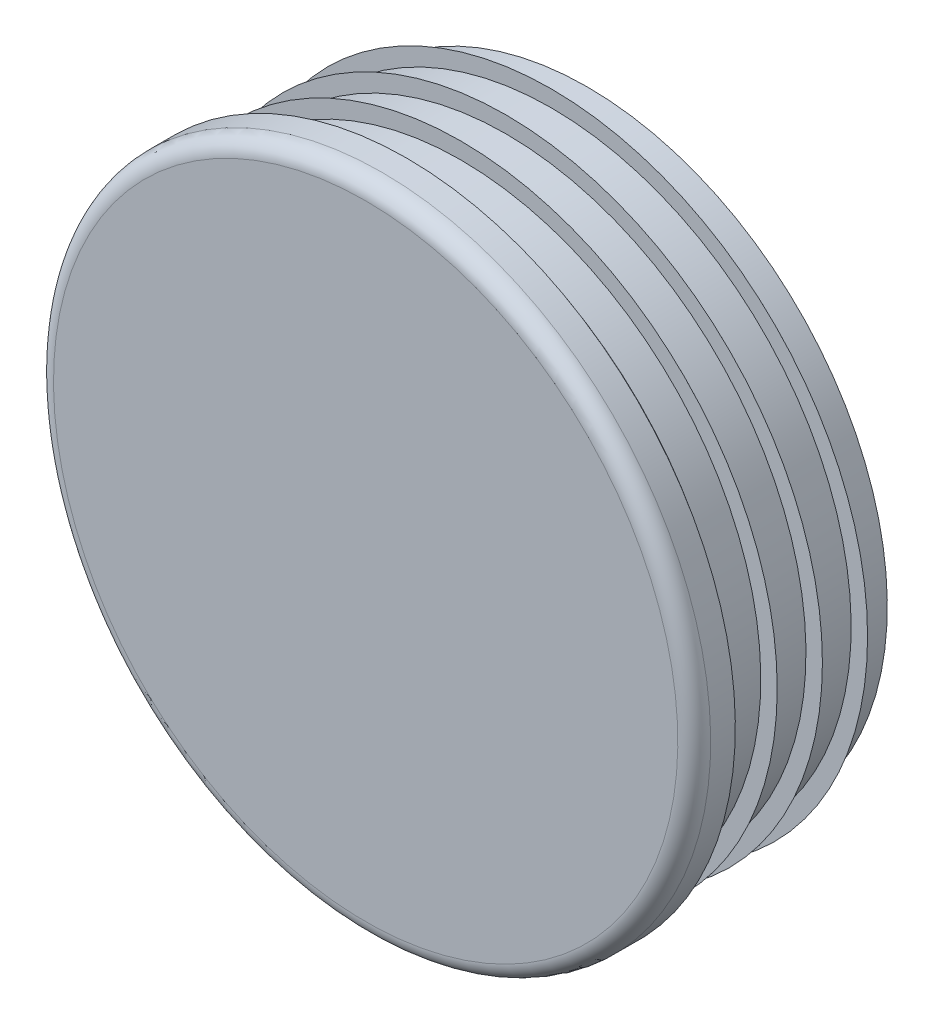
ISO-10303-21;
HEADER;
FILE_DESCRIPTION(('STEP AP214'),'2;1');
FILE_NAME('part.step','',(''),(''),'','','');
FILE_SCHEMA(('AUTOMOTIVE_DESIGN { 1 0 10303 214 1 1 1 1 }'));
ENDSEC;
DATA;
#1=APPLICATION_CONTEXT('core data for automotive mechanical design processes');
#2=APPLICATION_PROTOCOL_DEFINITION('international standard','automotive_design',2000,#1);
#3=PRODUCT_CONTEXT('',#1,'mechanical');
#4=PRODUCT('Part','Part','',(#3));
#5=PRODUCT_RELATED_PRODUCT_CATEGORY('part','',(#4));
#6=PRODUCT_DEFINITION_FORMATION('','',#4);
#7=PRODUCT_DEFINITION_CONTEXT('part definition',#1,'design');
#8=PRODUCT_DEFINITION('design','',#6,#7);
#9=PRODUCT_DEFINITION_SHAPE('','',#8);
#10=(LENGTH_UNIT() NAMED_UNIT(*) SI_UNIT(.MILLI.,.METRE.));
#11=(NAMED_UNIT(*) PLANE_ANGLE_UNIT() SI_UNIT($,.RADIAN.));
#12=(NAMED_UNIT(*) SI_UNIT($,.STERADIAN.) SOLID_ANGLE_UNIT());
#13=UNCERTAINTY_MEASURE_WITH_UNIT(LENGTH_MEASURE(1.E-05),#10,'distance_accuracy_value','');
#14=(GEOMETRIC_REPRESENTATION_CONTEXT(3) GLOBAL_UNCERTAINTY_ASSIGNED_CONTEXT((#13)) GLOBAL_UNIT_ASSIGNED_CONTEXT((#10,
#11,#12)) REPRESENTATION_CONTEXT('',''));
#15=CARTESIAN_POINT('',(0.,0.,0.));
#16=DIRECTION('',(0.,0.,1.));
#17=DIRECTION('',(1.,0.,0.));
#18=AXIS2_PLACEMENT_3D('',#15,#16,#17);
#19=CARTESIAN_POINT('',(0.,0.,5.));
#20=DIRECTION('',(0.,0.,-1.));
#21=DIRECTION('',(0.,1.,0.));
#22=AXIS2_PLACEMENT_3D('',#19,#20,#21);
#23=PLANE('',#22);
#24=CARTESIAN_POINT('',(0.,0.,5.));
#25=DIRECTION('',(0.,0.,-1.));
#26=DIRECTION('',(0.,1.,0.));
#27=AXIS2_PLACEMENT_3D('',#24,#25,#26);
#28=CIRCLE('',#27,38.);
#29=CARTESIAN_POINT('',(0.,38.,5.));
#30=VERTEX_POINT('',#29);
#31=EDGE_CURVE('E8',#30,#30,#28,.T.);
#32=ORIENTED_EDGE('',*,*,#31,.F.);
#33=EDGE_LOOP('',(#32));
#34=FACE_BOUND('',#33,.T.);
#35=ADVANCED_FACE('F12',(#34),#23,.F.);
#36=CARTESIAN_POINT('',(0.,0.,3.));
#37=DIRECTION('',(0.,0.,-1.));
#38=DIRECTION('',(0.,1.,0.));
#39=AXIS2_PLACEMENT_3D('',#36,#37,#38);
#40=TOROIDAL_SURFACE('',#39,38.,2.);
#41=ORIENTED_EDGE('',*,*,#31,.T.);
#42=EDGE_LOOP('',(#41));
#43=FACE_BOUND('',#42,.T.);
#44=CARTESIAN_POINT('',(0.,0.,3.));
#45=DIRECTION('',(0.,0.,-1.));
#46=DIRECTION('',(0.,1.,0.));
#47=AXIS2_PLACEMENT_3D('',#44,#45,#46);
#48=CIRCLE('',#47,40.);
#49=CARTESIAN_POINT('',(0.,40.,3.));
#50=VERTEX_POINT('',#49);
#51=EDGE_CURVE('E18',#50,#50,#48,.T.);
#52=ORIENTED_EDGE('',*,*,#51,.F.);
#53=EDGE_LOOP('',(#52));
#54=FACE_BOUND('',#53,.T.);
#55=ADVANCED_FACE('F159',(#43,#54),#40,.T.);
#56=CARTESIAN_POINT('',(0.,0.,-22.));
#57=DIRECTION('',(0.,0.,-1.));
#58=DIRECTION('',(0.,1.,0.));
#59=AXIS2_PLACEMENT_3D('',#56,#57,#58);
#60=CYLINDRICAL_SURFACE('',#59,40.);
#61=CARTESIAN_POINT('',(0.,0.,0.));
#62=DIRECTION('',(0.,0.,-1.));
#63=DIRECTION('',(0.,1.,0.));
#64=AXIS2_PLACEMENT_3D('',#61,#62,#63);
#65=CIRCLE('',#64,40.);
#66=CARTESIAN_POINT('',(0.,40.,0.));
#67=VERTEX_POINT('',#66);
#68=EDGE_CURVE('E22',#67,#67,#65,.T.);
#69=ORIENTED_EDGE('',*,*,#68,.F.);
#70=EDGE_LOOP('',(#69));
#71=FACE_BOUND('',#70,.T.);
#72=ORIENTED_EDGE('',*,*,#51,.T.);
#73=EDGE_LOOP('',(#72));
#74=FACE_BOUND('',#73,.T.);
#75=ADVANCED_FACE('F154',(#71,#74),#60,.T.);
#76=CARTESIAN_POINT('',(40.,0.,0.));
#77=DIRECTION('',(0.,0.,1.));
#78=DIRECTION('',(0.,-1.,0.));
#79=AXIS2_PLACEMENT_3D('',#76,#77,#78);
#80=PLANE('',#79);
#81=CARTESIAN_POINT('',(0.,0.,0.));
#82=DIRECTION('',(0.,0.,-1.));
#83=DIRECTION('',(0.,1.,0.));
#84=AXIS2_PLACEMENT_3D('',#81,#82,#83);
#85=CIRCLE('',#84,36.5);
#86=CARTESIAN_POINT('',(0.,36.5,0.));
#87=VERTEX_POINT('',#86);
#88=EDGE_CURVE('E26',#87,#87,#85,.T.);
#89=ORIENTED_EDGE('',*,*,#88,.F.);
#90=EDGE_LOOP('',(#89));
#91=FACE_BOUND('',#90,.T.);
#92=ORIENTED_EDGE('',*,*,#68,.T.);
#93=EDGE_LOOP('',(#92));
#94=FACE_BOUND('',#93,.T.);
#95=ADVANCED_FACE('F148',(#91,#94),#80,.F.);
#96=CARTESIAN_POINT('',(0.,0.,-22.));
#97=DIRECTION('',(0.,0.,-1.));
#98=DIRECTION('',(0.,1.,0.));
#99=AXIS2_PLACEMENT_3D('',#96,#97,#98);
#100=CYLINDRICAL_SURFACE('',#99,36.5);
#101=CARTESIAN_POINT('',(0.,0.,-1.1));
#102=DIRECTION('',(0.,0.,-1.));
#103=DIRECTION('',(0.,1.,0.));
#104=AXIS2_PLACEMENT_3D('',#101,#102,#103);
#105=CIRCLE('',#104,36.5);
#106=CARTESIAN_POINT('',(0.,36.5,-1.1));
#107=VERTEX_POINT('',#106);
#108=EDGE_CURVE('E31',#107,#107,#105,.T.);
#109=ORIENTED_EDGE('',*,*,#108,.F.);
#110=EDGE_LOOP('',(#109));
#111=FACE_BOUND('',#110,.T.);
#112=ORIENTED_EDGE('',*,*,#88,.T.);
#113=EDGE_LOOP('',(#112));
#114=FACE_BOUND('',#113,.T.);
#115=ADVANCED_FACE('F142',(#111,#114),#100,.T.);
#116=CARTESIAN_POINT('',(36.5,0.,-1.1));
#117=DIRECTION('',(0.,0.,-1.));
#118=DIRECTION('',(0.,1.,0.));
#119=AXIS2_PLACEMENT_3D('',#116,#117,#118);
#120=PLANE('',#119);
#121=CARTESIAN_POINT('',(0.,0.,-1.1));
#122=DIRECTION('',(0.,0.,-1.));
#123=DIRECTION('',(0.,1.,0.));
#124=AXIS2_PLACEMENT_3D('',#121,#122,#123);
#125=CIRCLE('',#124,38.5);
#126=CARTESIAN_POINT('',(0.,38.5,-1.1));
#127=VERTEX_POINT('',#126);
#128=EDGE_CURVE('E34',#127,#127,#125,.T.);
#129=ORIENTED_EDGE('',*,*,#128,.F.);
#130=EDGE_LOOP('',(#129));
#131=FACE_BOUND('',#130,.T.);
#132=ORIENTED_EDGE('',*,*,#108,.T.);
#133=EDGE_LOOP('',(#132));
#134=FACE_BOUND('',#133,.T.);
#135=ADVANCED_FACE('F136',(#131,#134),#120,.F.);
#136=CARTESIAN_POINT('',(0.,0.,-1.1));
#137=DIRECTION('',(0.,0.,1.));
#138=DIRECTION('',(0.,-1.,0.));
#139=AXIS2_PLACEMENT_3D('',#136,#137,#138);
#140=CONICAL_SURFACE('',#139,38.5,0.959931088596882);
#141=CARTESIAN_POINT('',(0.,0.,-2.50041507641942));
#142=DIRECTION('',(0.,0.,-1.));
#143=DIRECTION('',(0.,1.,0.));
#144=AXIS2_PLACEMENT_3D('',#141,#142,#143);
#145=CIRCLE('',#144,36.5);
#146=CARTESIAN_POINT('',(0.,36.5,-2.50041507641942));
#147=VERTEX_POINT('',#146);
#148=EDGE_CURVE('E37',#147,#147,#145,.T.);
#149=ORIENTED_EDGE('',*,*,#148,.F.);
#150=EDGE_LOOP('',(#149));
#151=FACE_BOUND('',#150,.T.);
#152=ORIENTED_EDGE('',*,*,#128,.T.);
#153=EDGE_LOOP('',(#152));
#154=FACE_BOUND('',#153,.T.);
#155=ADVANCED_FACE('F130',(#151,#154),#140,.T.);
#156=CARTESIAN_POINT('',(0.,0.,-22.));
#157=DIRECTION('',(0.,0.,-1.));
#158=DIRECTION('',(0.,1.,0.));
#159=AXIS2_PLACEMENT_3D('',#156,#157,#158);
#160=CYLINDRICAL_SURFACE('',#159,36.5);
#161=CARTESIAN_POINT('',(0.,0.,-6.6));
#162=DIRECTION('',(0.,0.,-1.));
#163=DIRECTION('',(0.,1.,0.));
#164=AXIS2_PLACEMENT_3D('',#161,#162,#163);
#165=CIRCLE('',#164,36.5);
#166=CARTESIAN_POINT('',(0.,36.5,-6.6));
#167=VERTEX_POINT('',#166);
#168=EDGE_CURVE('E40',#167,#167,#165,.T.);
#169=ORIENTED_EDGE('',*,*,#168,.F.);
#170=EDGE_LOOP('',(#169));
#171=FACE_BOUND('',#170,.T.);
#172=ORIENTED_EDGE('',*,*,#148,.T.);
#173=EDGE_LOOP('',(#172));
#174=FACE_BOUND('',#173,.T.);
#175=ADVANCED_FACE('F124',(#171,#174),#160,.T.);
#176=CARTESIAN_POINT('',(36.5,0.,-6.6));
#177=DIRECTION('',(0.,0.,-1.));
#178=DIRECTION('',(0.,1.,0.));
#179=AXIS2_PLACEMENT_3D('',#176,#177,#178);
#180=PLANE('',#179);
#181=CARTESIAN_POINT('',(0.,0.,-6.6));
#182=DIRECTION('',(0.,0.,-1.));
#183=DIRECTION('',(0.,1.,0.));
#184=AXIS2_PLACEMENT_3D('',#181,#182,#183);
#185=CIRCLE('',#184,38.5);
#186=CARTESIAN_POINT('',(0.,38.5,-6.6));
#187=VERTEX_POINT('',#186);
#188=EDGE_CURVE('E43',#187,#187,#185,.T.);
#189=ORIENTED_EDGE('',*,*,#188,.F.);
#190=EDGE_LOOP('',(#189));
#191=FACE_BOUND('',#190,.T.);
#192=ORIENTED_EDGE('',*,*,#168,.T.);
#193=EDGE_LOOP('',(#192));
#194=FACE_BOUND('',#193,.T.);
#195=ADVANCED_FACE('F118',(#191,#194),#180,.F.);
#196=CARTESIAN_POINT('',(0.,0.,-6.6));
#197=DIRECTION('',(0.,0.,1.));
#198=DIRECTION('',(0.,-1.,0.));
#199=AXIS2_PLACEMENT_3D('',#196,#197,#198);
#200=CONICAL_SURFACE('',#199,38.5,0.959931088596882);
#201=CARTESIAN_POINT('',(0.,0.,-8.00041507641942));
#202=DIRECTION('',(0.,0.,-1.));
#203=DIRECTION('',(0.,1.,0.));
#204=AXIS2_PLACEMENT_3D('',#201,#202,#203);
#205=CIRCLE('',#204,36.5);
#206=CARTESIAN_POINT('',(0.,36.5,-8.00041507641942));
#207=VERTEX_POINT('',#206);
#208=EDGE_CURVE('E46',#207,#207,#205,.T.);
#209=ORIENTED_EDGE('',*,*,#208,.F.);
#210=EDGE_LOOP('',(#209));
#211=FACE_BOUND('',#210,.T.);
#212=ORIENTED_EDGE('',*,*,#188,.T.);
#213=EDGE_LOOP('',(#212));
#214=FACE_BOUND('',#213,.T.);
#215=ADVANCED_FACE('F112',(#211,#214),#200,.T.);
#216=CARTESIAN_POINT('',(0.,0.,-22.));
#217=DIRECTION('',(0.,0.,-1.));
#218=DIRECTION('',(0.,1.,0.));
#219=AXIS2_PLACEMENT_3D('',#216,#217,#218);
#220=CYLINDRICAL_SURFACE('',#219,36.5);
#221=CARTESIAN_POINT('',(0.,0.,-12.1));
#222=DIRECTION('',(0.,0.,-1.));
#223=DIRECTION('',(0.,1.,0.));
#224=AXIS2_PLACEMENT_3D('',#221,#222,#223);
#225=CIRCLE('',#224,36.5);
#226=CARTESIAN_POINT('',(0.,36.5,-12.1));
#227=VERTEX_POINT('',#226);
#228=EDGE_CURVE('E49',#227,#227,#225,.T.);
#229=ORIENTED_EDGE('',*,*,#228,.F.);
#230=EDGE_LOOP('',(#229));
#231=FACE_BOUND('',#230,.T.);
#232=ORIENTED_EDGE('',*,*,#208,.T.);
#233=EDGE_LOOP('',(#232));
#234=FACE_BOUND('',#233,.T.);
#235=ADVANCED_FACE('F106',(#231,#234),#220,.T.);
#236=CARTESIAN_POINT('',(36.5,0.,-12.1));
#237=DIRECTION('',(0.,0.,-1.));
#238=DIRECTION('',(0.,1.,0.));
#239=AXIS2_PLACEMENT_3D('',#236,#237,#238);
#240=PLANE('',#239);
#241=CARTESIAN_POINT('',(0.,0.,-12.1));
#242=DIRECTION('',(0.,0.,-1.));
#243=DIRECTION('',(0.,1.,0.));
#244=AXIS2_PLACEMENT_3D('',#241,#242,#243);
#245=CIRCLE('',#244,38.5);
#246=CARTESIAN_POINT('',(0.,38.5,-12.1));
#247=VERTEX_POINT('',#246);
#248=EDGE_CURVE('E52',#247,#247,#245,.T.);
#249=ORIENTED_EDGE('',*,*,#248,.F.);
#250=EDGE_LOOP('',(#249));
#251=FACE_BOUND('',#250,.T.);
#252=ORIENTED_EDGE('',*,*,#228,.T.);
#253=EDGE_LOOP('',(#252));
#254=FACE_BOUND('',#253,.T.);
#255=ADVANCED_FACE('F100',(#251,#254),#240,.F.);
#256=CARTESIAN_POINT('',(0.,0.,-12.1));
#257=DIRECTION('',(0.,0.,1.));
#258=DIRECTION('',(0.,-1.,0.));
#259=AXIS2_PLACEMENT_3D('',#256,#257,#258);
#260=CONICAL_SURFACE('',#259,38.5,0.959931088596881);
#261=CARTESIAN_POINT('',(0.,0.,-13.5004150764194));
#262=DIRECTION('',(0.,0.,-1.));
#263=DIRECTION('',(0.,1.,0.));
#264=AXIS2_PLACEMENT_3D('',#261,#262,#263);
#265=CIRCLE('',#264,36.5);
#266=CARTESIAN_POINT('',(0.,36.5,-13.5004150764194));
#267=VERTEX_POINT('',#266);
#268=EDGE_CURVE('E55',#267,#267,#265,.T.);
#269=ORIENTED_EDGE('',*,*,#268,.F.);
#270=EDGE_LOOP('',(#269));
#271=FACE_BOUND('',#270,.T.);
#272=ORIENTED_EDGE('',*,*,#248,.T.);
#273=EDGE_LOOP('',(#272));
#274=FACE_BOUND('',#273,.T.);
#275=ADVANCED_FACE('F94',(#271,#274),#260,.T.);
#276=CARTESIAN_POINT('',(0.,0.,-22.));
#277=DIRECTION('',(0.,0.,-1.));
#278=DIRECTION('',(0.,1.,0.));
#279=AXIS2_PLACEMENT_3D('',#276,#277,#278);
#280=CYLINDRICAL_SURFACE('',#279,36.5);
#281=CARTESIAN_POINT('',(0.,0.,-17.6));
#282=DIRECTION('',(0.,0.,-1.));
#283=DIRECTION('',(0.,1.,0.));
#284=AXIS2_PLACEMENT_3D('',#281,#282,#283);
#285=CIRCLE('',#284,36.5);
#286=CARTESIAN_POINT('',(0.,36.5,-17.6));
#287=VERTEX_POINT('',#286);
#288=EDGE_CURVE('E58',#287,#287,#285,.T.);
#289=ORIENTED_EDGE('',*,*,#288,.F.);
#290=EDGE_LOOP('',(#289));
#291=FACE_BOUND('',#290,.T.);
#292=ORIENTED_EDGE('',*,*,#268,.T.);
#293=EDGE_LOOP('',(#292));
#294=FACE_BOUND('',#293,.T.);
#295=ADVANCED_FACE('F88',(#291,#294),#280,.T.);
#296=CARTESIAN_POINT('',(36.5,0.,-17.6));
#297=DIRECTION('',(0.,0.,-1.));
#298=DIRECTION('',(0.,1.,0.));
#299=AXIS2_PLACEMENT_3D('',#296,#297,#298);
#300=PLANE('',#299);
#301=CARTESIAN_POINT('',(0.,0.,-17.6));
#302=DIRECTION('',(0.,0.,-1.));
#303=DIRECTION('',(0.,1.,0.));
#304=AXIS2_PLACEMENT_3D('',#301,#302,#303);
#305=CIRCLE('',#304,38.5);
#306=CARTESIAN_POINT('',(0.,38.5,-17.6));
#307=VERTEX_POINT('',#306);
#308=EDGE_CURVE('E61',#307,#307,#305,.T.);
#309=ORIENTED_EDGE('',*,*,#308,.F.);
#310=EDGE_LOOP('',(#309));
#311=FACE_BOUND('',#310,.T.);
#312=ORIENTED_EDGE('',*,*,#288,.T.);
#313=EDGE_LOOP('',(#312));
#314=FACE_BOUND('',#313,.T.);
#315=ADVANCED_FACE('F82',(#311,#314),#300,.F.);
#316=CARTESIAN_POINT('',(0.,0.,-17.6));
#317=DIRECTION('',(0.,0.,1.));
#318=DIRECTION('',(0.,-1.,0.));
#319=AXIS2_PLACEMENT_3D('',#316,#317,#318);
#320=CONICAL_SURFACE('',#319,38.5,0.959931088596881);
#321=CARTESIAN_POINT('',(0.,0.,-19.0004150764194));
#322=DIRECTION('',(0.,0.,-1.));
#323=DIRECTION('',(0.,1.,0.));
#324=AXIS2_PLACEMENT_3D('',#321,#322,#323);
#325=CIRCLE('',#324,36.5);
#326=CARTESIAN_POINT('',(0.,36.5,-19.0004150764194));
#327=VERTEX_POINT('',#326);
#328=EDGE_CURVE('E64',#327,#327,#325,.T.);
#329=ORIENTED_EDGE('',*,*,#328,.F.);
#330=EDGE_LOOP('',(#329));
#331=FACE_BOUND('',#330,.T.);
#332=ORIENTED_EDGE('',*,*,#308,.T.);
#333=EDGE_LOOP('',(#332));
#334=FACE_BOUND('',#333,.T.);
#335=ADVANCED_FACE('F76',(#331,#334),#320,.T.);
#336=CARTESIAN_POINT('',(0.,0.,-22.));
#337=DIRECTION('',(0.,0.,-1.));
#338=DIRECTION('',(0.,1.,0.));
#339=AXIS2_PLACEMENT_3D('',#336,#337,#338);
#340=CYLINDRICAL_SURFACE('',#339,36.5);
#341=CARTESIAN_POINT('',(0.,0.,-22.));
#342=DIRECTION('',(0.,0.,-1.));
#343=DIRECTION('',(0.,1.,0.));
#344=AXIS2_PLACEMENT_3D('',#341,#342,#343);
#345=CIRCLE('',#344,36.5);
#346=CARTESIAN_POINT('',(0.,36.5,-22.));
#347=VERTEX_POINT('',#346);
#348=EDGE_CURVE('E67',#347,#347,#345,.T.);
#349=ORIENTED_EDGE('',*,*,#348,.F.);
#350=EDGE_LOOP('',(#349));
#351=FACE_BOUND('',#350,.T.);
#352=ORIENTED_EDGE('',*,*,#328,.T.);
#353=EDGE_LOOP('',(#352));
#354=FACE_BOUND('',#353,.T.);
#355=ADVANCED_FACE('F73',(#351,#354),#340,.T.);
#356=CARTESIAN_POINT('',(36.5,0.,-22.));
#357=DIRECTION('',(0.,0.,1.));
#358=DIRECTION('',(0.,-1.,0.));
#359=AXIS2_PLACEMENT_3D('',#356,#357,#358);
#360=PLANE('',#359);
#361=ORIENTED_EDGE('',*,*,#348,.T.);
#362=EDGE_LOOP('',(#361));
#363=FACE_BOUND('',#362,.T.);
#364=ADVANCED_FACE('F71',(#363),#360,.F.);
#365=CLOSED_SHELL('',(#35,#55,#75,#95,#115,#135,#155,#175,#195,#215,#235,#255,#275,#295,#315,
#335,#355,#364));
#366=MANIFOLD_SOLID_BREP('B1',#365);
#367=ADVANCED_BREP_SHAPE_REPRESENTATION('',(#18,#366),#14);
#368=SHAPE_DEFINITION_REPRESENTATION(#9,#367);
ENDSEC;
END-ISO-10303-21;
